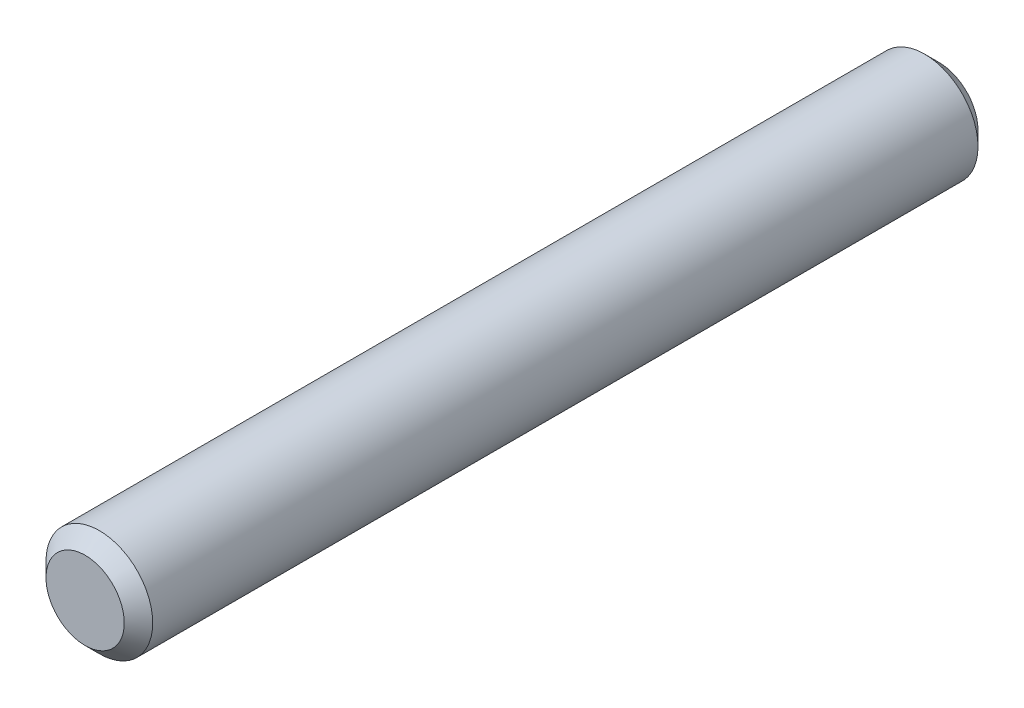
from build123d import *

# Parameters (mm, degrees)
AUFSATZ_LINEAR_AUSTRAGEN1_DEPTH      = 6
AUFSATZ_LINEAR_AUSTRAGEN1_DEPTH_BACK = 6
SKIZZE1_R                            = 0.75
FASE1_SIZE                           = 0.2


with BuildPart() as part:
    # Skizze1 → Aufsatz-Linear austragen1 (new, two sides: drawn at the far end of the back side and taken through both)
    with BuildSketch(Plane.XY.offset(-AUFSATZ_LINEAR_AUSTRAGEN1_DEPTH_BACK)):
        Circle(SKIZZE1_R)
    extrude(amount=AUFSATZ_LINEAR_AUSTRAGEN1_DEPTH + AUFSATZ_LINEAR_AUSTRAGEN1_DEPTH_BACK)

    # Fase1
    fase1_edges = [part.edges().sort_by_distance(p)[0] for p in [
        (-0.75, 0, -6),
        (-0.75, 0, 6),
    ]]
    chamfer(fase1_edges, length=FASE1_SIZE)


solid = part.part
